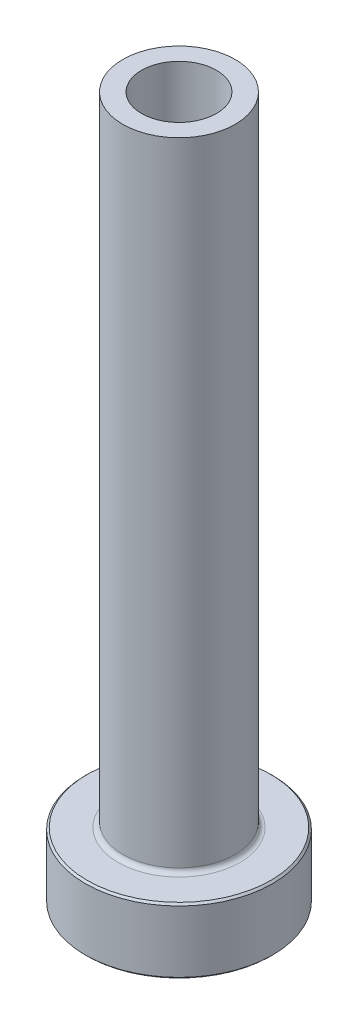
from build123d import *

# Parameters (mm, degrees)
FILLET1_R     = 0.5
CHAMFER1_SIZE = 0.2
CHAMFER3_SIZE = 0.5


with BuildPart() as part:
    # Sketch1 → Revolve1 (revolve)
    with BuildSketch(Plane.XY, mode=Mode.PRIVATE) as revolve1_sk:
        Polygon((-4, 75), (-6, 75), (-6, 7), (-10, 7), (-10, 0), (-4.25, 0), (-4.25, 18), (-4, 30), align=None)
    revolve(revolve1_sk.sketch.rotate(Axis((0, 92.187680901, 0), (0, -1, 0)), 270), axis=Axis((0, 92.187680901, 0), (0, -1, 0)))

    # Fillet1
    fillet1_edges = [part.edges().sort_by_distance(p)[0] for p in [
        (0, 7, -6),
    ]]
    fillet(fillet1_edges, radius=FILLET1_R)

    # Chamfer1
    chamfer1_edges = [part.edges().sort_by_distance(p)[0] for p in [
        (0, 0, -10),
        (0, 7, -10),
    ]]
    chamfer(chamfer1_edges, length=CHAMFER1_SIZE)

    # Chamfer3
    chamfer3_edges = [part.edges().sort_by_distance(p)[0] for p in [
        (0, 0, -4.25),
    ]]
    chamfer(chamfer3_edges, length=CHAMFER3_SIZE)


solid = part.part
